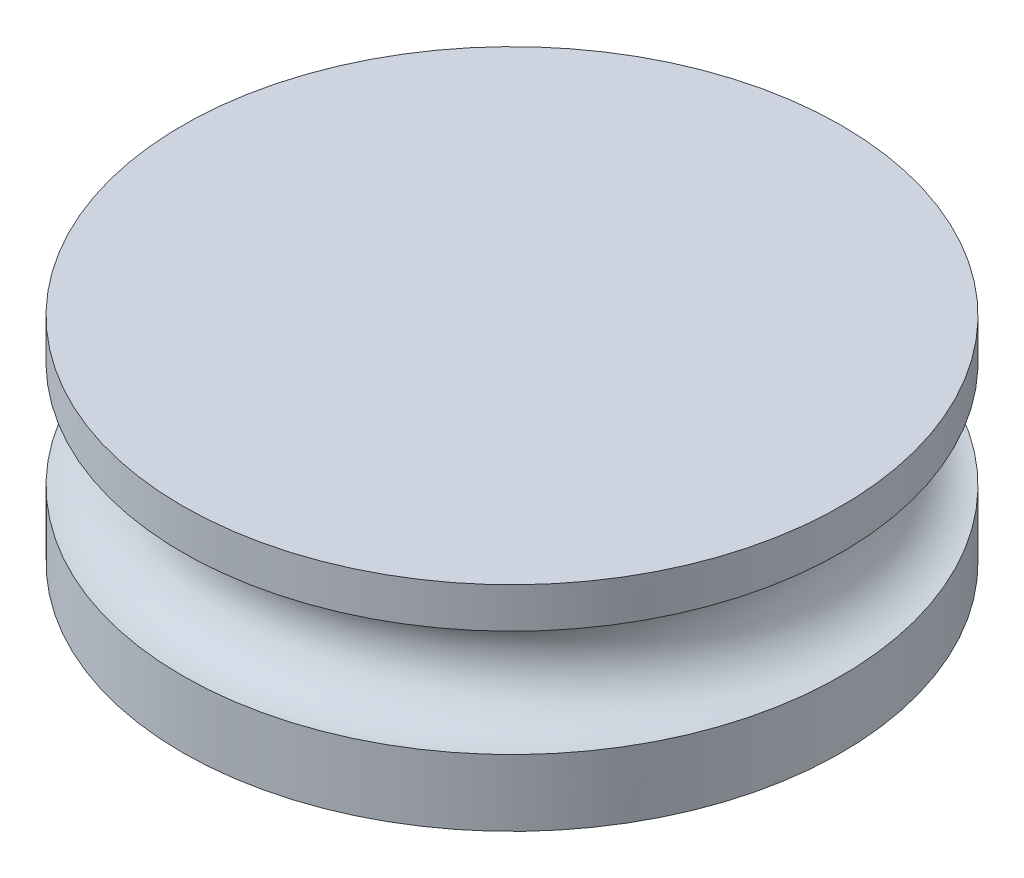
from build123d import *

# Parameters (mm, degrees)
SKETCH1_R      = 78.36459504
EXTRUDE1_DEPTH = 50.8
SKETCH2_R      = 12.7


with BuildPart() as part:
    # Sketch1 → Extrude1 (new body)
    with BuildSketch(Plane(origin=(0, 0, 0), x_dir=(1, 0, 0), z_dir=(0, 1, 0))):
        with Locations(Location((0, 0, 0), (0, 0, 270))):
            Circle(SKETCH1_R)
    extrude(amount=EXTRUDE1_DEPTH)

    # Sketch2 → Cut-Revolve1 (revolve, cut)
    with BuildSketch(Plane.XY, mode=Mode.PRIVATE) as cut_revolve1_sk:
        with Locations((-78.36459504, 28.522380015)):
            Circle(SKETCH2_R)
    revolve(cut_revolve1_sk.sketch.rotate(Axis((0, 0, 0), (0, 1, 0)), 270), axis=Axis((0, 0, 0), (0, 1, 0)), mode=Mode.SUBTRACT)


solid = part.part
